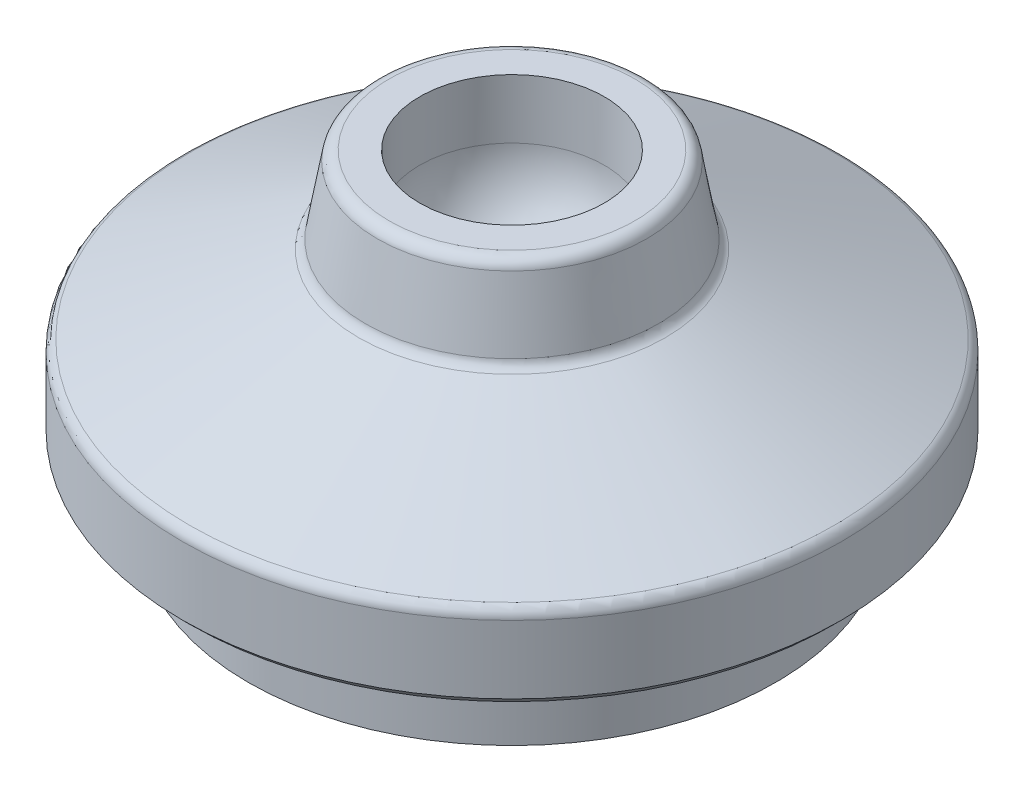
ISO-10303-21;
HEADER;
FILE_DESCRIPTION(('STEP AP214'),'2;1');
FILE_NAME('part.step','',(''),(''),'','','');
FILE_SCHEMA(('AUTOMOTIVE_DESIGN { 1 0 10303 214 1 1 1 1 }'));
ENDSEC;
DATA;
#1=APPLICATION_CONTEXT('core data for automotive mechanical design processes');
#2=APPLICATION_PROTOCOL_DEFINITION('international standard','automotive_design',2000,#1);
#3=PRODUCT_CONTEXT('',#1,'mechanical');
#4=PRODUCT('Part','Part','',(#3));
#5=PRODUCT_RELATED_PRODUCT_CATEGORY('part','',(#4));
#6=PRODUCT_DEFINITION_FORMATION('','',#4);
#7=PRODUCT_DEFINITION_CONTEXT('part definition',#1,'design');
#8=PRODUCT_DEFINITION('design','',#6,#7);
#9=PRODUCT_DEFINITION_SHAPE('','',#8);
#10=(LENGTH_UNIT() NAMED_UNIT(*) SI_UNIT(.MILLI.,.METRE.));
#11=(NAMED_UNIT(*) PLANE_ANGLE_UNIT() SI_UNIT($,.RADIAN.));
#12=(NAMED_UNIT(*) SI_UNIT($,.STERADIAN.) SOLID_ANGLE_UNIT());
#13=UNCERTAINTY_MEASURE_WITH_UNIT(LENGTH_MEASURE(1.E-05),#10,'distance_accuracy_value','');
#14=(GEOMETRIC_REPRESENTATION_CONTEXT(3) GLOBAL_UNCERTAINTY_ASSIGNED_CONTEXT((#13)) GLOBAL_UNIT_ASSIGNED_CONTEXT((#10,
#11,#12)) REPRESENTATION_CONTEXT('',''));
#15=CARTESIAN_POINT('',(0.,0.,0.));
#16=DIRECTION('',(0.,0.,1.));
#17=DIRECTION('',(1.,0.,0.));
#18=AXIS2_PLACEMENT_3D('',#15,#16,#17);
#19=CARTESIAN_POINT('',(0.,-6.,0.));
#20=DIRECTION('',(0.,1.,0.));
#21=DIRECTION('',(0.,0.,1.));
#22=AXIS2_PLACEMENT_3D('',#19,#20,#21);
#23=CYLINDRICAL_SURFACE('',#22,9.2);
#24=CARTESIAN_POINT('',(0.,0.,0.));
#25=DIRECTION('',(0.,1.,0.));
#26=DIRECTION('',(0.,0.,1.));
#27=AXIS2_PLACEMENT_3D('',#24,#25,#26);
#28=CIRCLE('',#27,9.2);
#29=CARTESIAN_POINT('',(0.,0.,9.2));
#30=VERTEX_POINT('',#29);
#31=EDGE_CURVE('E58',#30,#30,#28,.T.);
#32=ORIENTED_EDGE('',*,*,#31,.T.);
#33=EDGE_LOOP('',(#32));
#34=FACE_BOUND('',#33,.T.);
#35=CARTESIAN_POINT('',(0.,-6.,0.));
#36=DIRECTION('',(0.,1.,0.));
#37=DIRECTION('',(0.,0.,1.));
#38=AXIS2_PLACEMENT_3D('',#35,#36,#37);
#39=CIRCLE('',#38,9.2);
#40=CARTESIAN_POINT('',(0.,-6.,9.2));
#41=VERTEX_POINT('',#40);
#42=EDGE_CURVE('E8',#41,#41,#39,.T.);
#43=ORIENTED_EDGE('',*,*,#42,.F.);
#44=EDGE_LOOP('',(#43));
#45=FACE_BOUND('',#44,.T.);
#46=ADVANCED_FACE('F12',(#34,#45),#23,.F.);
#47=CARTESIAN_POINT('',(20.,-6.,0.));
#48=DIRECTION('',(0.,-1.,0.));
#49=DIRECTION('',(0.,0.,-1.));
#50=AXIS2_PLACEMENT_3D('',#47,#48,#49);
#51=PLANE('',#50);
#52=ORIENTED_EDGE('',*,*,#42,.T.);
#53=EDGE_LOOP('',(#52));
#54=FACE_BOUND('',#53,.T.);
#55=CARTESIAN_POINT('',(0.,-6.,0.));
#56=DIRECTION('',(0.,1.,0.));
#57=DIRECTION('',(0.,0.,1.));
#58=AXIS2_PLACEMENT_3D('',#55,#56,#57);
#59=CIRCLE('',#58,20.);
#60=CARTESIAN_POINT('',(0.,-6.,20.));
#61=VERTEX_POINT('',#60);
#62=EDGE_CURVE('E18',#61,#61,#59,.T.);
#63=ORIENTED_EDGE('',*,*,#62,.F.);
#64=EDGE_LOOP('',(#63));
#65=FACE_BOUND('',#64,.T.);
#66=ADVANCED_FACE('F77',(#54,#65),#51,.T.);
#67=CARTESIAN_POINT('',(0.,-6.,0.));
#68=DIRECTION('',(0.,1.,0.));
#69=DIRECTION('',(0.,0.,1.));
#70=AXIS2_PLACEMENT_3D('',#67,#68,#69);
#71=CYLINDRICAL_SURFACE('',#70,20.);
#72=ORIENTED_EDGE('',*,*,#62,.T.);
#73=EDGE_LOOP('',(#72));
#74=FACE_BOUND('',#73,.T.);
#75=CARTESIAN_POINT('',(0.,0.,0.));
#76=DIRECTION('',(0.,1.,0.));
#77=DIRECTION('',(0.,0.,1.));
#78=AXIS2_PLACEMENT_3D('',#75,#76,#77);
#79=CIRCLE('',#78,20.);
#80=CARTESIAN_POINT('',(0.,0.,20.));
#81=VERTEX_POINT('',#80);
#82=EDGE_CURVE('E22',#81,#81,#79,.T.);
#83=ORIENTED_EDGE('',*,*,#82,.F.);
#84=EDGE_LOOP('',(#83));
#85=FACE_BOUND('',#84,.T.);
#86=ADVANCED_FACE('F82',(#74,#85),#71,.T.);
#87=CARTESIAN_POINT('',(24.4,0.,0.));
#88=DIRECTION('',(0.,-1.,0.));
#89=DIRECTION('',(0.,0.,-1.));
#90=AXIS2_PLACEMENT_3D('',#87,#88,#89);
#91=PLANE('',#90);
#92=ORIENTED_EDGE('',*,*,#82,.T.);
#93=EDGE_LOOP('',(#92));
#94=FACE_BOUND('',#93,.T.);
#95=CARTESIAN_POINT('',(0.,0.,0.));
#96=DIRECTION('',(0.,1.,0.));
#97=DIRECTION('',(0.,0.,1.));
#98=AXIS2_PLACEMENT_3D('',#95,#96,#97);
#99=CIRCLE('',#98,24.4);
#100=CARTESIAN_POINT('',(0.,0.,24.4));
#101=VERTEX_POINT('',#100);
#102=EDGE_CURVE('E26',#101,#101,#99,.T.);
#103=ORIENTED_EDGE('',*,*,#102,.F.);
#104=EDGE_LOOP('',(#103));
#105=FACE_BOUND('',#104,.T.);
#106=ADVANCED_FACE('F87',(#94,#105),#91,.T.);
#107=CARTESIAN_POINT('',(0.,0.600000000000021,0.));
#108=DIRECTION('',(0.,1.,0.));
#109=DIRECTION('',(0.,0.,1.));
#110=AXIS2_PLACEMENT_3D('',#107,#108,#109);
#111=CONICAL_SURFACE('',#110,25.,0.785398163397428);
#112=ORIENTED_EDGE('',*,*,#102,.T.);
#113=EDGE_LOOP('',(#112));
#114=FACE_BOUND('',#113,.T.);
#115=CARTESIAN_POINT('',(0.,0.600000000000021,0.));
#116=DIRECTION('',(0.,1.,0.));
#117=DIRECTION('',(0.,0.,1.));
#118=AXIS2_PLACEMENT_3D('',#115,#116,#117);
#119=CIRCLE('',#118,25.);
#120=CARTESIAN_POINT('',(0.,0.600000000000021,25.));
#121=VERTEX_POINT('',#120);
#122=EDGE_CURVE('E31',#121,#121,#119,.T.);
#123=ORIENTED_EDGE('',*,*,#122,.F.);
#124=EDGE_LOOP('',(#123));
#125=FACE_BOUND('',#124,.T.);
#126=ADVANCED_FACE('F93',(#114,#125),#111,.T.);
#127=CARTESIAN_POINT('',(0.,-6.,0.));
#128=DIRECTION('',(0.,1.,0.));
#129=DIRECTION('',(0.,0.,1.));
#130=AXIS2_PLACEMENT_3D('',#127,#128,#129);
#131=CYLINDRICAL_SURFACE('',#130,25.);
#132=ORIENTED_EDGE('',*,*,#122,.T.);
#133=EDGE_LOOP('',(#132));
#134=FACE_BOUND('',#133,.T.);
#135=CARTESIAN_POINT('',(0.,5.75612183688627,0.));
#136=DIRECTION('',(0.,1.,0.));
#137=DIRECTION('',(0.,0.,1.));
#138=AXIS2_PLACEMENT_3D('',#135,#136,#137);
#139=CIRCLE('',#138,25.);
#140=CARTESIAN_POINT('',(0.,5.75612183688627,25.));
#141=VERTEX_POINT('',#140);
#142=EDGE_CURVE('E34',#141,#141,#139,.T.);
#143=ORIENTED_EDGE('',*,*,#142,.F.);
#144=EDGE_LOOP('',(#143));
#145=FACE_BOUND('',#144,.T.);
#146=ADVANCED_FACE('F97',(#134,#145),#131,.T.);
#147=CARTESIAN_POINT('',(0.,5.75612183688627,0.));
#148=DIRECTION('',(0.,1.,0.));
#149=DIRECTION('',(0.,0.,1.));
#150=AXIS2_PLACEMENT_3D('',#147,#148,#149);
#151=TOROIDAL_SURFACE('',#150,24.1,0.9);
#152=ORIENTED_EDGE('',*,*,#142,.T.);
#153=EDGE_LOOP('',(#152));
#154=FACE_BOUND('',#153,.T.);
#155=CARTESIAN_POINT('',(0.,6.5740929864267,0.));
#156=DIRECTION('',(0.,1.,0.));
#157=DIRECTION('',(0.,0.,1.));
#158=AXIS2_PLACEMENT_3D('',#155,#156,#157);
#159=CIRCLE('',#158,24.4753973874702);
#160=CARTESIAN_POINT('',(0.,6.5740929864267,24.4753973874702));
#161=VERTEX_POINT('',#160);
#162=EDGE_CURVE('E37',#161,#161,#159,.T.);
#163=ORIENTED_EDGE('',*,*,#162,.F.);
#164=EDGE_LOOP('',(#163));
#165=FACE_BOUND('',#164,.T.);
#166=ADVANCED_FACE('F101',(#154,#165),#151,.T.);
#167=CARTESIAN_POINT('',(0.,12.4697965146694,0.));
#168=DIRECTION('',(0.,-1.,0.));
#169=DIRECTION('',(0.,0.,-1.));
#170=AXIS2_PLACEMENT_3D('',#167,#168,#169);
#171=CONICAL_SURFACE('',#170,11.6289696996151,1.14053512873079);
#172=ORIENTED_EDGE('',*,*,#162,.T.);
#173=EDGE_LOOP('',(#172));
#174=FACE_BOUND('',#173,.T.);
#175=CARTESIAN_POINT('',(0.,12.4697965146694,0.));
#176=DIRECTION('',(0.,1.,0.));
#177=DIRECTION('',(0.,0.,1.));
#178=AXIS2_PLACEMENT_3D('',#175,#176,#177);
#179=CIRCLE('',#178,11.6289696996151);
#180=CARTESIAN_POINT('',(0.,12.4697965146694,11.6289696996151));
#181=VERTEX_POINT('',#180);
#182=EDGE_CURVE('E40',#181,#181,#179,.T.);
#183=ORIENTED_EDGE('',*,*,#182,.F.);
#184=EDGE_LOOP('',(#183));
#185=FACE_BOUND('',#184,.T.);
#186=ADVANCED_FACE('F105',(#174,#185),#171,.T.);
#187=CARTESIAN_POINT('',(0.,13.2877676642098,0.));
#188=DIRECTION('',(0.,1.,0.));
#189=DIRECTION('',(0.,0.,1.));
#190=AXIS2_PLACEMENT_3D('',#187,#188,#189);
#191=TOROIDAL_SURFACE('',#190,12.0043670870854,0.9);
#192=ORIENTED_EDGE('',*,*,#182,.T.);
#193=EDGE_LOOP('',(#192));
#194=FACE_BOUND('',#193,.T.);
#195=CARTESIAN_POINT('',(0.,13.1314843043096,0.));
#196=DIRECTION('',(0.,1.,0.));
#197=DIRECTION('',(0.,0.,1.));
#198=AXIS2_PLACEMENT_3D('',#195,#196,#197);
#199=CIRCLE('',#198,11.1180401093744);
#200=CARTESIAN_POINT('',(0.,13.1314843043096,11.1180401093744));
#201=VERTEX_POINT('',#200);
#202=EDGE_CURVE('E43',#201,#201,#199,.T.);
#203=ORIENTED_EDGE('',*,*,#202,.F.);
#204=EDGE_LOOP('',(#203));
#205=FACE_BOUND('',#204,.T.);
#206=ADVANCED_FACE('F109',(#194,#205),#191,.F.);
#207=CARTESIAN_POINT('',(0.,18.2562833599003,0.));
#208=DIRECTION('',(0.,-1.,0.));
#209=DIRECTION('',(0.,0.,-1.));
#210=AXIS2_PLACEMENT_3D('',#207,#208,#209);
#211=CONICAL_SURFACE('',#210,10.2143997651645,0.174532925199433);
#212=ORIENTED_EDGE('',*,*,#202,.T.);
#213=EDGE_LOOP('',(#212));
#214=FACE_BOUND('',#213,.T.);
#215=CARTESIAN_POINT('',(0.,18.2562833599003,0.));
#216=DIRECTION('',(0.,1.,0.));
#217=DIRECTION('',(0.,0.,1.));
#218=AXIS2_PLACEMENT_3D('',#215,#216,#217);
#219=CIRCLE('',#218,10.2143997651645);
#220=CARTESIAN_POINT('',(0.,18.2562833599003,10.2143997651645));
#221=VERTEX_POINT('',#220);
#222=EDGE_CURVE('E46',#221,#221,#219,.T.);
#223=ORIENTED_EDGE('',*,*,#222,.F.);
#224=EDGE_LOOP('',(#223));
#225=FACE_BOUND('',#224,.T.);
#226=ADVANCED_FACE('F113',(#214,#225),#211,.T.);
#227=CARTESIAN_POINT('',(0.,18.1,0.));
#228=DIRECTION('',(0.,1.,0.));
#229=DIRECTION('',(0.,0.,1.));
#230=AXIS2_PLACEMENT_3D('',#227,#228,#229);
#231=TOROIDAL_SURFACE('',#230,9.32807278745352,0.9);
#232=ORIENTED_EDGE('',*,*,#222,.T.);
#233=EDGE_LOOP('',(#232));
#234=FACE_BOUND('',#233,.T.);
#235=CARTESIAN_POINT('',(0.,19.,0.));
#236=DIRECTION('',(0.,1.,0.));
#237=DIRECTION('',(0.,0.,1.));
#238=AXIS2_PLACEMENT_3D('',#235,#236,#237);
#239=CIRCLE('',#238,9.32807278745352);
#240=CARTESIAN_POINT('',(0.,19.,9.32807278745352));
#241=VERTEX_POINT('',#240);
#242=EDGE_CURVE('E49',#241,#241,#239,.T.);
#243=ORIENTED_EDGE('',*,*,#242,.F.);
#244=EDGE_LOOP('',(#243));
#245=FACE_BOUND('',#244,.T.);
#246=ADVANCED_FACE('F117',(#234,#245),#231,.T.);
#247=CARTESIAN_POINT('',(7.,19.,0.));
#248=DIRECTION('',(0.,1.,0.));
#249=DIRECTION('',(0.,0.,1.));
#250=AXIS2_PLACEMENT_3D('',#247,#248,#249);
#251=PLANE('',#250);
#252=ORIENTED_EDGE('',*,*,#242,.T.);
#253=EDGE_LOOP('',(#252));
#254=FACE_BOUND('',#253,.T.);
#255=CARTESIAN_POINT('',(0.,19.,0.));
#256=DIRECTION('',(0.,1.,0.));
#257=DIRECTION('',(0.,0.,1.));
#258=AXIS2_PLACEMENT_3D('',#255,#256,#257);
#259=CIRCLE('',#258,7.);
#260=CARTESIAN_POINT('',(0.,19.,7.));
#261=VERTEX_POINT('',#260);
#262=EDGE_CURVE('E52',#261,#261,#259,.T.);
#263=ORIENTED_EDGE('',*,*,#262,.F.);
#264=EDGE_LOOP('',(#263));
#265=FACE_BOUND('',#264,.T.);
#266=ADVANCED_FACE('F121',(#254,#265),#251,.T.);
#267=CARTESIAN_POINT('',(0.,-6.,0.));
#268=DIRECTION('',(0.,1.,0.));
#269=DIRECTION('',(0.,0.,1.));
#270=AXIS2_PLACEMENT_3D('',#267,#268,#269);
#271=CYLINDRICAL_SURFACE('',#270,7.);
#272=ORIENTED_EDGE('',*,*,#262,.T.);
#273=EDGE_LOOP('',(#272));
#274=FACE_BOUND('',#273,.T.);
#275=CARTESIAN_POINT('',(0.,14.5,0.));
#276=DIRECTION('',(0.,1.,0.));
#277=DIRECTION('',(0.,0.,1.));
#278=AXIS2_PLACEMENT_3D('',#275,#276,#277);
#279=CIRCLE('',#278,7.);
#280=CARTESIAN_POINT('',(0.,14.5,7.));
#281=VERTEX_POINT('',#280);
#282=EDGE_CURVE('E55',#281,#281,#279,.T.);
#283=ORIENTED_EDGE('',*,*,#282,.F.);
#284=EDGE_LOOP('',(#283));
#285=FACE_BOUND('',#284,.T.);
#286=ADVANCED_FACE('F73',(#274,#285),#271,.F.);
#287=CARTESIAN_POINT('',(0.,14.5,0.));
#288=DIRECTION('',(0.,1.,0.));
#289=DIRECTION('',(-1.,0.,0.));
#290=AXIS2_PLACEMENT_3D('',#287,#288,#289);
#291=SPHERICAL_SURFACE('',#290,7.);
#292=ORIENTED_EDGE('',*,*,#282,.T.);
#293=EDGE_LOOP('',(#292));
#294=FACE_BOUND('',#293,.T.);
#295=ADVANCED_FACE('F66',(#294),#291,.F.);
#296=CARTESIAN_POINT('',(9.2,0.,0.));
#297=DIRECTION('',(0.,-1.,0.));
#298=DIRECTION('',(0.,0.,-1.));
#299=AXIS2_PLACEMENT_3D('',#296,#297,#298);
#300=PLANE('',#299);
#301=ORIENTED_EDGE('',*,*,#31,.F.);
#302=EDGE_LOOP('',(#301));
#303=FACE_BOUND('',#302,.T.);
#304=ADVANCED_FACE('F64',(#303),#300,.T.);
#305=CLOSED_SHELL('',(#46,#66,#86,#106,#126,#146,#166,#186,#206,#226,#246,#266,#286,#295,#304));
#306=MANIFOLD_SOLID_BREP('B1',#305);
#307=ADVANCED_BREP_SHAPE_REPRESENTATION('',(#18,#306),#14);
#308=SHAPE_DEFINITION_REPRESENTATION(#9,#307);
ENDSEC;
END-ISO-10303-21;
